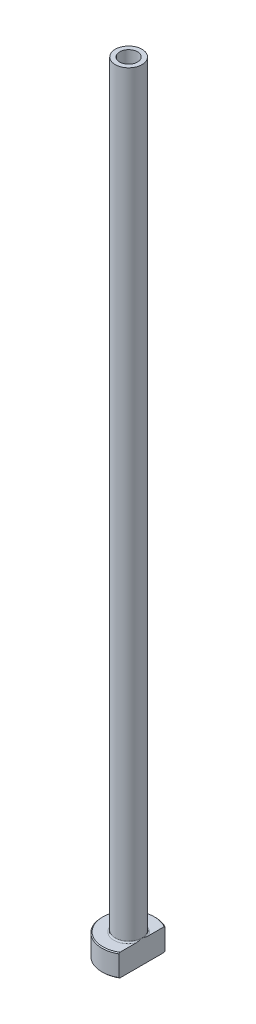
from build123d import *

# Parameters (mm, degrees)
FILLET1_R          = 0.3
CHAMFER1_SIZE      = 0.2
CUT_EXTRUDE1_DEPTH = 176.205593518
CHAMFER2_SIZE      = 0.5


with BuildPart() as part:
    # Sketch1 → Revolve1 (revolve)
    with BuildSketch(Plane.XY, mode=Mode.PRIVATE) as revolve1_sk:
        Polygon((-2, 175), (-3, 175), (-3, 5), (-6, 5), (-6, 0), (-2.25, 0), (-2.25, 118), (-2, 130), align=None)
    revolve(revolve1_sk.sketch.rotate(Axis((0, 92.187680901, 0), (0, -1, 0)), 270), axis=Axis((0, 92.187680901, 0), (0, -1, 0)))

    # Fillet1
    fillet1_edges = [part.edges().sort_by_distance(p)[0] for p in [
        (0, 5, -3),
    ]]
    fillet(fillet1_edges, radius=FILLET1_R)

    # Chamfer1
    chamfer1_edges = [part.edges().sort_by_distance(p)[0] for p in [
        (0, 0, -6),
        (0, 5, -6),
    ]]
    chamfer(chamfer1_edges, length=CHAMFER1_SIZE)

    # Sketch2 → Cut-Extrude1 (cut, through all)
    with BuildSketch(Plane.XZ):
        with BuildLine():
            Line((3, 5.196152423), (3, -5.196152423))
            ThreePointArc((3, -5.196152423), (6, 0), (3, 5.196152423))
        make_face()
    extrude(amount=-CUT_EXTRUDE1_DEPTH, mode=Mode.SUBTRACT)

    # Chamfer2
    chamfer2_edges = [part.edges().sort_by_distance(p)[0] for p in [
        (0, 0, -2.25),
    ]]
    chamfer(chamfer2_edges, length=CHAMFER2_SIZE)


solid = part.part
